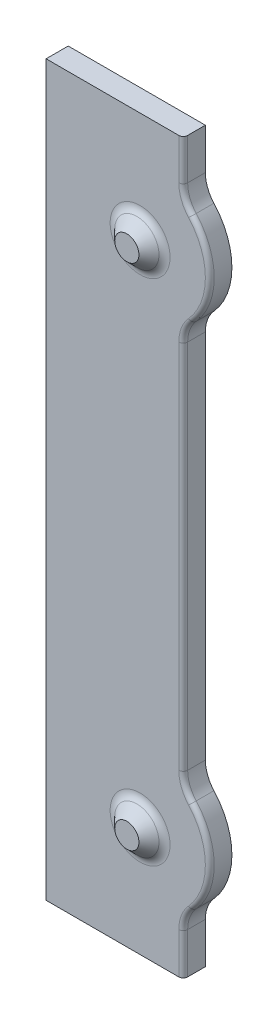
ISO-10303-21;
HEADER;
FILE_DESCRIPTION(('STEP AP214'),'2;1');
FILE_NAME('part.step','',(''),(''),'','','');
FILE_SCHEMA(('AUTOMOTIVE_DESIGN { 1 0 10303 214 1 1 1 1 }'));
ENDSEC;
DATA;
#1=APPLICATION_CONTEXT('core data for automotive mechanical design processes');
#2=APPLICATION_PROTOCOL_DEFINITION('international standard','automotive_design',2000,#1);
#3=PRODUCT_CONTEXT('',#1,'mechanical');
#4=PRODUCT('Part','Part','',(#3));
#5=PRODUCT_RELATED_PRODUCT_CATEGORY('part','',(#4));
#6=PRODUCT_DEFINITION_FORMATION('','',#4);
#7=PRODUCT_DEFINITION_CONTEXT('part definition',#1,'design');
#8=PRODUCT_DEFINITION('design','',#6,#7);
#9=PRODUCT_DEFINITION_SHAPE('','',#8);
#10=(LENGTH_UNIT() NAMED_UNIT(*) SI_UNIT(.MILLI.,.METRE.));
#11=(NAMED_UNIT(*) PLANE_ANGLE_UNIT() SI_UNIT($,.RADIAN.));
#12=(NAMED_UNIT(*) SI_UNIT($,.STERADIAN.) SOLID_ANGLE_UNIT());
#13=UNCERTAINTY_MEASURE_WITH_UNIT(LENGTH_MEASURE(1.E-05),#10,'distance_accuracy_value','');
#14=(GEOMETRIC_REPRESENTATION_CONTEXT(3) GLOBAL_UNCERTAINTY_ASSIGNED_CONTEXT((#13)) GLOBAL_UNIT_ASSIGNED_CONTEXT((#10,
#11,#12)) REPRESENTATION_CONTEXT('',''));
#15=CARTESIAN_POINT('',(0.,0.,0.));
#16=DIRECTION('',(0.,0.,1.));
#17=DIRECTION('',(1.,0.,0.));
#18=AXIS2_PLACEMENT_3D('',#15,#16,#17);
#19=CARTESIAN_POINT('',(0.,-29.21,2.54));
#20=DIRECTION('',(0.,0.,1.));
#21=DIRECTION('',(1.,0.,0.));
#22=AXIS2_PLACEMENT_3D('',#19,#20,#21);
#23=PLANE('',#22);
#24=CARTESIAN_POINT('',(0.,-29.21,2.54));
#25=DIRECTION('',(0.,0.,1.));
#26=DIRECTION('',(1.,0.,0.));
#27=AXIS2_PLACEMENT_3D('',#24,#25,#26);
#28=CIRCLE('',#27,3.43911372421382);
#29=CARTESIAN_POINT('',(3.43911372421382,-29.21,2.54));
#30=VERTEX_POINT('',#29);
#31=EDGE_CURVE('E12',#30,#30,#28,.F.);
#32=ORIENTED_EDGE('',*,*,#31,.T.);
#33=EDGE_LOOP('',(#32));
#34=FACE_BOUND('',#33,.T.);
#35=DIRECTION('',(1.,0.,0.));
#36=VECTOR('',#35,1.);
#37=CARTESIAN_POINT('',(-10.795,-41.8436129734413,2.54));
#38=LINE('',#37,#36);
#39=CARTESIAN_POINT('',(-10.795,-41.8436129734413,2.54));
#40=VERTEX_POINT('',#39);
#41=CARTESIAN_POINT('',(4.44500000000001,-41.8436129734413,2.54));
#42=VERTEX_POINT('',#41);
#43=EDGE_CURVE('E160',#40,#42,#38,.T.);
#44=ORIENTED_EDGE('',*,*,#43,.T.);
#45=DIRECTION('',(0.,1.,0.));
#46=VECTOR('',#45,1.);
#47=CARTESIAN_POINT('',(4.44500000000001,-37.1289362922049,2.54));
#48=LINE('',#47,#46);
#49=CARTESIAN_POINT('',(4.44500000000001,-37.1289362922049,2.54));
#50=VERTEX_POINT('',#49);
#51=EDGE_CURVE('E236',#42,#50,#48,.T.);
#52=ORIENTED_EDGE('',*,*,#51,.T.);
#53=CARTESIAN_POINT('',(8.76300000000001,-37.1289362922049,2.54));
#54=DIRECTION('',(0.,0.,1.));
#55=DIRECTION('',(1.,0.,0.));
#56=AXIS2_PLACEMENT_3D('',#53,#54,#55);
#57=CIRCLE('',#56,4.318);
#58=CARTESIAN_POINT('',(5.55932258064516,-34.2338413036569,2.54));
#59=VERTEX_POINT('',#58);
#60=EDGE_CURVE('E234',#50,#59,#57,.F.);
#61=ORIENTED_EDGE('',*,*,#60,.T.);
#62=CARTESIAN_POINT('',(0.,-29.21,2.54));
#63=DIRECTION('',(0.,0.,1.));
#64=DIRECTION('',(1.,0.,0.));
#65=AXIS2_PLACEMENT_3D('',#62,#63,#64);
#66=CIRCLE('',#65,7.493);
#67=CARTESIAN_POINT('',(5.55932258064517,-24.1861586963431,2.54));
#68=VERTEX_POINT('',#67);
#69=EDGE_CURVE('E232',#59,#68,#66,.T.);
#70=ORIENTED_EDGE('',*,*,#69,.T.);
#71=CARTESIAN_POINT('',(8.76300000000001,-21.2910637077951,2.54));
#72=DIRECTION('',(0.,0.,1.));
#73=DIRECTION('',(1.,0.,0.));
#74=AXIS2_PLACEMENT_3D('',#71,#72,#73);
#75=CIRCLE('',#74,4.318);
#76=CARTESIAN_POINT('',(4.44500000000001,-21.2910637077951,2.54));
#77=VERTEX_POINT('',#76);
#78=EDGE_CURVE('E230',#68,#77,#75,.F.);
#79=ORIENTED_EDGE('',*,*,#78,.T.);
#80=DIRECTION('',(0.,1.,0.));
#81=VECTOR('',#80,1.);
#82=CARTESIAN_POINT('',(4.44500000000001,21.2910637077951,2.54));
#83=LINE('',#82,#81);
#84=CARTESIAN_POINT('',(4.44500000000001,21.2910637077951,2.54));
#85=VERTEX_POINT('',#84);
#86=EDGE_CURVE('E228',#77,#85,#83,.T.);
#87=ORIENTED_EDGE('',*,*,#86,.T.);
#88=CARTESIAN_POINT('',(8.76300000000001,21.2910637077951,2.54));
#89=DIRECTION('',(0.,0.,1.));
#90=DIRECTION('',(1.,0.,0.));
#91=AXIS2_PLACEMENT_3D('',#88,#89,#90);
#92=CIRCLE('',#91,4.318);
#93=CARTESIAN_POINT('',(5.55932258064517,24.1861586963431,2.54));
#94=VERTEX_POINT('',#93);
#95=EDGE_CURVE('E226',#85,#94,#92,.F.);
#96=ORIENTED_EDGE('',*,*,#95,.T.);
#97=CARTESIAN_POINT('',(0.,29.21,2.54));
#98=DIRECTION('',(0.,0.,1.));
#99=DIRECTION('',(1.,0.,0.));
#100=AXIS2_PLACEMENT_3D('',#97,#98,#99);
#101=CIRCLE('',#100,7.493);
#102=CARTESIAN_POINT('',(5.55932258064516,34.2338413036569,2.54));
#103=VERTEX_POINT('',#102);
#104=EDGE_CURVE('E220',#94,#103,#101,.T.);
#105=ORIENTED_EDGE('',*,*,#104,.T.);
#106=CARTESIAN_POINT('',(8.76300000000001,37.1289362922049,2.54));
#107=DIRECTION('',(0.,0.,1.));
#108=DIRECTION('',(1.,0.,0.));
#109=AXIS2_PLACEMENT_3D('',#106,#107,#108);
#110=CIRCLE('',#109,4.318);
#111=CARTESIAN_POINT('',(4.44500000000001,37.1289362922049,2.54));
#112=VERTEX_POINT('',#111);
#113=EDGE_CURVE('E222',#103,#112,#110,.F.);
#114=ORIENTED_EDGE('',*,*,#113,.T.);
#115=DIRECTION('',(0.,1.,0.));
#116=VECTOR('',#115,1.);
#117=CARTESIAN_POINT('',(4.44500000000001,41.8436129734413,2.54));
#118=LINE('',#117,#116);
#119=CARTESIAN_POINT('',(4.44500000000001,41.8436129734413,2.54));
#120=VERTEX_POINT('',#119);
#121=EDGE_CURVE('E224',#112,#120,#118,.T.);
#122=ORIENTED_EDGE('',*,*,#121,.T.);
#123=DIRECTION('',(-1.,0.,0.));
#124=VECTOR('',#123,1.);
#125=CARTESIAN_POINT('',(-10.795,41.8436129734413,2.54));
#126=LINE('',#125,#124);
#127=CARTESIAN_POINT('',(-10.795,41.8436129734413,2.54));
#128=VERTEX_POINT('',#127);
#129=EDGE_CURVE('E173',#120,#128,#126,.T.);
#130=ORIENTED_EDGE('',*,*,#129,.T.);
#131=DIRECTION('',(0.,-1.,0.));
#132=VECTOR('',#131,1.);
#133=CARTESIAN_POINT('',(-10.795,41.8436129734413,2.54));
#134=LINE('',#133,#132);
#135=EDGE_CURVE('E174',#128,#40,#134,.T.);
#136=ORIENTED_EDGE('',*,*,#135,.T.);
#137=EDGE_LOOP('',(#44,#52,#61,#70,#79,#87,#96,#105,#114,#122,#130,#136));
#138=FACE_BOUND('',#137,.T.);
#139=CARTESIAN_POINT('',(0.,29.21,2.54));
#140=DIRECTION('',(0.,0.,1.));
#141=DIRECTION('',(1.,0.,0.));
#142=AXIS2_PLACEMENT_3D('',#139,#140,#141);
#143=CIRCLE('',#142,3.43911372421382);
#144=CARTESIAN_POINT('',(3.43911372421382,29.21,2.54));
#145=VERTEX_POINT('',#144);
#146=EDGE_CURVE('E257',#145,#145,#143,.F.);
#147=ORIENTED_EDGE('',*,*,#146,.T.);
#148=EDGE_LOOP('',(#147));
#149=FACE_BOUND('',#148,.T.);
#150=ADVANCED_FACE('F39',(#34,#138,#149),#23,.T.);
#151=CARTESIAN_POINT('',(-10.795,41.8436129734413,2.54));
#152=DIRECTION('',(1.,0.,0.));
#153=DIRECTION('',(0.,0.,-1.));
#154=AXIS2_PLACEMENT_3D('',#151,#152,#153);
#155=PLANE('',#154);
#156=DIRECTION('',(0.,-1.,0.));
#157=VECTOR('',#156,1.);
#158=CARTESIAN_POINT('',(-10.795,41.8436129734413,0.));
#159=LINE('',#158,#157);
#160=CARTESIAN_POINT('',(-10.795,41.8436129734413,0.));
#161=VERTEX_POINT('',#160);
#162=CARTESIAN_POINT('',(-10.795,-41.8436129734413,0.));
#163=VERTEX_POINT('',#162);
#164=EDGE_CURVE('E186',#161,#163,#159,.T.);
#165=ORIENTED_EDGE('',*,*,#164,.T.);
#166=DIRECTION('',(0.,0.,-1.));
#167=VECTOR('',#166,1.);
#168=CARTESIAN_POINT('',(-10.795,-41.8436129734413,2.54));
#169=LINE('',#168,#167);
#170=EDGE_CURVE('E166',#40,#163,#169,.T.);
#171=ORIENTED_EDGE('',*,*,#170,.F.);
#172=ORIENTED_EDGE('',*,*,#135,.F.);
#173=DIRECTION('',(0.,0.,-1.));
#174=VECTOR('',#173,1.);
#175=CARTESIAN_POINT('',(-10.795,41.8436129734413,2.54));
#176=LINE('',#175,#174);
#177=EDGE_CURVE('E414',#128,#161,#176,.T.);
#178=ORIENTED_EDGE('',*,*,#177,.T.);
#179=EDGE_LOOP('',(#165,#171,#172,#178));
#180=FACE_BOUND('',#179,.T.);
#181=ADVANCED_FACE('F184',(#180),#155,.F.);
#182=CARTESIAN_POINT('',(-10.795,-41.8436129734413,2.54));
#183=DIRECTION('',(0.,1.,0.));
#184=DIRECTION('',(0.,0.,1.));
#185=AXIS2_PLACEMENT_3D('',#182,#183,#184);
#186=PLANE('',#185);
#187=DIRECTION('',(0.,0.,-1.));
#188=VECTOR('',#187,1.);
#189=CARTESIAN_POINT('',(4.95300000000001,-41.8436129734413,2.54));
#190=LINE('',#189,#188);
#191=CARTESIAN_POINT('',(4.95300000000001,-41.8436129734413,2.032));
#192=VERTEX_POINT('',#191);
#193=CARTESIAN_POINT('',(4.95300000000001,-41.8436129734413,0.));
#194=VERTEX_POINT('',#193);
#195=EDGE_CURVE('E188',#192,#194,#190,.T.);
#196=ORIENTED_EDGE('',*,*,#195,.F.);
#197=CARTESIAN_POINT('',(4.44500000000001,-41.8436129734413,2.032));
#198=DIRECTION('',(0.,1.,0.));
#199=DIRECTION('',(0.,0.,1.));
#200=AXIS2_PLACEMENT_3D('',#197,#198,#199);
#201=CIRCLE('',#200,0.508);
#202=EDGE_CURVE('E169',#192,#42,#201,.F.);
#203=ORIENTED_EDGE('',*,*,#202,.T.);
#204=ORIENTED_EDGE('',*,*,#43,.F.);
#205=ORIENTED_EDGE('',*,*,#170,.T.);
#206=DIRECTION('',(1.,0.,0.));
#207=VECTOR('',#206,1.);
#208=CARTESIAN_POINT('',(-10.795,-41.8436129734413,0.));
#209=LINE('',#208,#207);
#210=EDGE_CURVE('E416',#163,#194,#209,.T.);
#211=ORIENTED_EDGE('',*,*,#210,.T.);
#212=EDGE_LOOP('',(#196,#203,#204,#205,#211));
#213=FACE_BOUND('',#212,.T.);
#214=ADVANCED_FACE('F163',(#213),#186,.F.);
#215=CARTESIAN_POINT('',(4.95300000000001,-35.4936129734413,2.54));
#216=DIRECTION('',(-1.,0.,0.));
#217=DIRECTION('',(0.,0.,1.));
#218=AXIS2_PLACEMENT_3D('',#215,#216,#217);
#219=PLANE('',#218);
#220=DIRECTION('',(0.,0.,1.));
#221=VECTOR('',#220,1.);
#222=CARTESIAN_POINT('',(4.95300000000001,-37.1289362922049,2.54));
#223=LINE('',#222,#221);
#224=CARTESIAN_POINT('',(4.95300000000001,-37.1289362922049,0.));
#225=VERTEX_POINT('',#224);
#226=CARTESIAN_POINT('',(4.95300000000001,-37.1289362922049,2.032));
#227=VERTEX_POINT('',#226);
#228=EDGE_CURVE('E209',#225,#227,#223,.T.);
#229=ORIENTED_EDGE('',*,*,#228,.T.);
#230=DIRECTION('',(0.,1.,0.));
#231=VECTOR('',#230,1.);
#232=CARTESIAN_POINT('',(4.95300000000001,-41.8436129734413,2.032));
#233=LINE('',#232,#231);
#234=EDGE_CURVE('E238',#227,#192,#233,.F.);
#235=ORIENTED_EDGE('',*,*,#234,.T.);
#236=ORIENTED_EDGE('',*,*,#195,.T.);
#237=DIRECTION('',(0.,1.,0.));
#238=VECTOR('',#237,1.);
#239=CARTESIAN_POINT('',(4.95300000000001,-35.4936129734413,0.));
#240=LINE('',#239,#238);
#241=EDGE_CURVE('E418',#194,#225,#240,.T.);
#242=ORIENTED_EDGE('',*,*,#241,.T.);
#243=EDGE_LOOP('',(#229,#235,#236,#242));
#244=FACE_BOUND('',#243,.T.);
#245=ADVANCED_FACE('F334',(#244),#219,.F.);
#246=CARTESIAN_POINT('',(0.,-29.21,2.54));
#247=DIRECTION('',(0.,0.,-1.));
#248=DIRECTION('',(-1.,0.,0.));
#249=AXIS2_PLACEMENT_3D('',#246,#247,#248);
#250=CYLINDRICAL_SURFACE('',#249,8.001);
#251=DIRECTION('',(0.,0.,-1.));
#252=VECTOR('',#251,1.);
#253=CARTESIAN_POINT('',(5.93622580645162,-23.8455592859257,2.54));
#254=LINE('',#253,#252);
#255=CARTESIAN_POINT('',(5.93622580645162,-23.8455592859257,0.));
#256=VERTEX_POINT('',#255);
#257=CARTESIAN_POINT('',(5.93622580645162,-23.8455592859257,2.032));
#258=VERTEX_POINT('',#257);
#259=EDGE_CURVE('E206',#256,#258,#254,.F.);
#260=ORIENTED_EDGE('',*,*,#259,.T.);
#261=CARTESIAN_POINT('',(0.,-29.21,2.032));
#262=DIRECTION('',(0.,0.,1.));
#263=DIRECTION('',(1.,0.,0.));
#264=AXIS2_PLACEMENT_3D('',#261,#262,#263);
#265=CIRCLE('',#264,8.001);
#266=CARTESIAN_POINT('',(5.93622580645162,-34.5744407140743,2.032));
#267=VERTEX_POINT('',#266);
#268=EDGE_CURVE('E243',#258,#267,#265,.F.);
#269=ORIENTED_EDGE('',*,*,#268,.T.);
#270=DIRECTION('',(0.,0.,-1.));
#271=VECTOR('',#270,1.);
#272=CARTESIAN_POINT('',(5.93622580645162,-34.5744407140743,2.54));
#273=LINE('',#272,#271);
#274=CARTESIAN_POINT('',(5.93622580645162,-34.5744407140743,0.));
#275=VERTEX_POINT('',#274);
#276=EDGE_CURVE('E204',#267,#275,#273,.T.);
#277=ORIENTED_EDGE('',*,*,#276,.T.);
#278=CARTESIAN_POINT('',(0.,-29.21,0.));
#279=DIRECTION('',(0.,0.,1.));
#280=DIRECTION('',(1.,0.,0.));
#281=AXIS2_PLACEMENT_3D('',#278,#279,#280);
#282=CIRCLE('',#281,8.001);
#283=EDGE_CURVE('E421',#275,#256,#282,.T.);
#284=ORIENTED_EDGE('',*,*,#283,.T.);
#285=EDGE_LOOP('',(#260,#269,#277,#284));
#286=FACE_BOUND('',#285,.T.);
#287=ADVANCED_FACE('F330',(#286),#250,.T.);
#288=CARTESIAN_POINT('',(4.95300000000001,22.9263870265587,2.54));
#289=DIRECTION('',(-1.,0.,0.));
#290=DIRECTION('',(0.,0.,1.));
#291=AXIS2_PLACEMENT_3D('',#288,#289,#290);
#292=PLANE('',#291);
#293=DIRECTION('',(0.,0.,1.));
#294=VECTOR('',#293,1.);
#295=CARTESIAN_POINT('',(4.95300000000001,21.2910637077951,2.54));
#296=LINE('',#295,#294);
#297=CARTESIAN_POINT('',(4.95300000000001,21.2910637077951,0.));
#298=VERTEX_POINT('',#297);
#299=CARTESIAN_POINT('',(4.95300000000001,21.2910637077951,2.032));
#300=VERTEX_POINT('',#299);
#301=EDGE_CURVE('E201',#298,#300,#296,.T.);
#302=ORIENTED_EDGE('',*,*,#301,.T.);
#303=DIRECTION('',(0.,1.,0.));
#304=VECTOR('',#303,1.);
#305=CARTESIAN_POINT('',(4.95300000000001,-21.2910637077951,2.032));
#306=LINE('',#305,#304);
#307=CARTESIAN_POINT('',(4.95300000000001,-21.2910637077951,2.032));
#308=VERTEX_POINT('',#307);
#309=EDGE_CURVE('E247',#300,#308,#306,.F.);
#310=ORIENTED_EDGE('',*,*,#309,.T.);
#311=DIRECTION('',(0.,0.,1.));
#312=VECTOR('',#311,1.);
#313=CARTESIAN_POINT('',(4.95300000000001,-21.2910637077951,0.));
#314=LINE('',#313,#312);
#315=CARTESIAN_POINT('',(4.95300000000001,-21.2910637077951,0.));
#316=VERTEX_POINT('',#315);
#317=EDGE_CURVE('E199',#308,#316,#314,.F.);
#318=ORIENTED_EDGE('',*,*,#317,.T.);
#319=DIRECTION('',(0.,1.,0.));
#320=VECTOR('',#319,1.);
#321=CARTESIAN_POINT('',(4.95300000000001,22.9263870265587,0.));
#322=LINE('',#321,#320);
#323=EDGE_CURVE('E424',#316,#298,#322,.T.);
#324=ORIENTED_EDGE('',*,*,#323,.T.);
#325=EDGE_LOOP('',(#302,#310,#318,#324));
#326=FACE_BOUND('',#325,.T.);
#327=ADVANCED_FACE('F326',(#326),#292,.F.);
#328=CARTESIAN_POINT('',(0.,29.21,2.54));
#329=DIRECTION('',(0.,0.,-1.));
#330=DIRECTION('',(-1.,0.,0.));
#331=AXIS2_PLACEMENT_3D('',#328,#329,#330);
#332=CYLINDRICAL_SURFACE('',#331,8.001);
#333=DIRECTION('',(0.,0.,-1.));
#334=VECTOR('',#333,1.);
#335=CARTESIAN_POINT('',(5.93622580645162,34.5744407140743,2.54));
#336=LINE('',#335,#334);
#337=CARTESIAN_POINT('',(5.93622580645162,34.5744407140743,0.));
#338=VERTEX_POINT('',#337);
#339=CARTESIAN_POINT('',(5.93622580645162,34.5744407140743,2.032));
#340=VERTEX_POINT('',#339);
#341=EDGE_CURVE('E197',#338,#340,#336,.F.);
#342=ORIENTED_EDGE('',*,*,#341,.T.);
#343=CARTESIAN_POINT('',(0.,29.21,2.032));
#344=DIRECTION('',(0.,0.,1.));
#345=DIRECTION('',(1.,0.,0.));
#346=AXIS2_PLACEMENT_3D('',#343,#344,#345);
#347=CIRCLE('',#346,8.001);
#348=CARTESIAN_POINT('',(5.93622580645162,23.8455592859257,2.032));
#349=VERTEX_POINT('',#348);
#350=EDGE_CURVE('E255',#340,#349,#347,.F.);
#351=ORIENTED_EDGE('',*,*,#350,.T.);
#352=DIRECTION('',(0.,0.,-1.));
#353=VECTOR('',#352,1.);
#354=CARTESIAN_POINT('',(5.93622580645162,23.8455592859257,2.54));
#355=LINE('',#354,#353);
#356=CARTESIAN_POINT('',(5.93622580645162,23.8455592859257,0.));
#357=VERTEX_POINT('',#356);
#358=EDGE_CURVE('E190',#349,#357,#355,.T.);
#359=ORIENTED_EDGE('',*,*,#358,.T.);
#360=CARTESIAN_POINT('',(0.,29.21,0.));
#361=DIRECTION('',(0.,0.,1.));
#362=DIRECTION('',(-1.,0.,0.));
#363=AXIS2_PLACEMENT_3D('',#360,#361,#362);
#364=CIRCLE('',#363,8.001);
#365=EDGE_CURVE('E427',#357,#338,#364,.T.);
#366=ORIENTED_EDGE('',*,*,#365,.T.);
#367=EDGE_LOOP('',(#342,#351,#359,#366));
#368=FACE_BOUND('',#367,.T.);
#369=ADVANCED_FACE('F323',(#368),#332,.T.);
#370=CARTESIAN_POINT('',(4.95300000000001,41.8436129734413,2.54));
#371=DIRECTION('',(-1.,0.,0.));
#372=DIRECTION('',(0.,0.,1.));
#373=AXIS2_PLACEMENT_3D('',#370,#371,#372);
#374=PLANE('',#373);
#375=DIRECTION('',(0.,0.,-1.));
#376=VECTOR('',#375,1.);
#377=CARTESIAN_POINT('',(4.95300000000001,41.8436129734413,2.54));
#378=LINE('',#377,#376);
#379=CARTESIAN_POINT('',(4.95300000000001,41.8436129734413,2.032));
#380=VERTEX_POINT('',#379);
#381=CARTESIAN_POINT('',(4.95300000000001,41.8436129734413,0.));
#382=VERTEX_POINT('',#381);
#383=EDGE_CURVE('E192',#380,#382,#378,.T.);
#384=ORIENTED_EDGE('',*,*,#383,.F.);
#385=DIRECTION('',(0.,1.,0.));
#386=VECTOR('',#385,1.);
#387=CARTESIAN_POINT('',(4.95300000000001,37.1289362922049,2.032));
#388=LINE('',#387,#386);
#389=CARTESIAN_POINT('',(4.95300000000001,37.1289362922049,2.032));
#390=VERTEX_POINT('',#389);
#391=EDGE_CURVE('E62',#380,#390,#388,.F.);
#392=ORIENTED_EDGE('',*,*,#391,.T.);
#393=DIRECTION('',(0.,0.,1.));
#394=VECTOR('',#393,1.);
#395=CARTESIAN_POINT('',(4.95300000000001,37.1289362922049,0.));
#396=LINE('',#395,#394);
#397=CARTESIAN_POINT('',(4.95300000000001,37.1289362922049,0.));
#398=VERTEX_POINT('',#397);
#399=EDGE_CURVE('E187',#390,#398,#396,.F.);
#400=ORIENTED_EDGE('',*,*,#399,.T.);
#401=DIRECTION('',(0.,1.,0.));
#402=VECTOR('',#401,1.);
#403=CARTESIAN_POINT('',(4.95300000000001,41.8436129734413,0.));
#404=LINE('',#403,#402);
#405=EDGE_CURVE('E430',#398,#382,#404,.T.);
#406=ORIENTED_EDGE('',*,*,#405,.T.);
#407=EDGE_LOOP('',(#384,#392,#400,#406));
#408=FACE_BOUND('',#407,.T.);
#409=ADVANCED_FACE('F319',(#408),#374,.F.);
#410=CARTESIAN_POINT('',(-10.795,41.8436129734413,2.54));
#411=DIRECTION('',(0.,-1.,0.));
#412=DIRECTION('',(0.,0.,-1.));
#413=AXIS2_PLACEMENT_3D('',#410,#411,#412);
#414=PLANE('',#413);
#415=ORIENTED_EDGE('',*,*,#129,.F.);
#416=CARTESIAN_POINT('',(4.44500000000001,41.8436129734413,2.032));
#417=DIRECTION('',(0.,-1.,0.));
#418=DIRECTION('',(0.,0.,-1.));
#419=AXIS2_PLACEMENT_3D('',#416,#417,#418);
#420=CIRCLE('',#419,0.508);
#421=EDGE_CURVE('E251',#120,#380,#420,.F.);
#422=ORIENTED_EDGE('',*,*,#421,.T.);
#423=ORIENTED_EDGE('',*,*,#383,.T.);
#424=DIRECTION('',(-1.,0.,0.));
#425=VECTOR('',#424,1.);
#426=CARTESIAN_POINT('',(-10.795,41.8436129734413,0.));
#427=LINE('',#426,#425);
#428=EDGE_CURVE('E182',#382,#161,#427,.T.);
#429=ORIENTED_EDGE('',*,*,#428,.T.);
#430=ORIENTED_EDGE('',*,*,#177,.F.);
#431=EDGE_LOOP('',(#415,#422,#423,#429,#430));
#432=FACE_BOUND('',#431,.T.);
#433=ADVANCED_FACE('F315',(#432),#414,.F.);
#434=CARTESIAN_POINT('',(0.,-29.21,0.));
#435=DIRECTION('',(0.,0.,1.));
#436=DIRECTION('',(1.,0.,0.));
#437=AXIS2_PLACEMENT_3D('',#434,#435,#436);
#438=PLANE('',#437);
#439=ORIENTED_EDGE('',*,*,#164,.F.);
#440=ORIENTED_EDGE('',*,*,#428,.F.);
#441=ORIENTED_EDGE('',*,*,#405,.F.);
#442=CARTESIAN_POINT('',(8.76300000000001,37.1289362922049,0.));
#443=DIRECTION('',(0.,0.,1.));
#444=DIRECTION('',(1.,0.,0.));
#445=AXIS2_PLACEMENT_3D('',#442,#443,#444);
#446=CIRCLE('',#445,3.81);
#447=EDGE_CURVE('E212',#398,#338,#446,.T.);
#448=ORIENTED_EDGE('',*,*,#447,.T.);
#449=ORIENTED_EDGE('',*,*,#365,.F.);
#450=CARTESIAN_POINT('',(8.76300000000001,21.2910637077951,0.));
#451=DIRECTION('',(0.,0.,1.));
#452=DIRECTION('',(1.,0.,0.));
#453=AXIS2_PLACEMENT_3D('',#450,#451,#452);
#454=CIRCLE('',#453,3.81);
#455=EDGE_CURVE('E214',#357,#298,#454,.T.);
#456=ORIENTED_EDGE('',*,*,#455,.T.);
#457=ORIENTED_EDGE('',*,*,#323,.F.);
#458=CARTESIAN_POINT('',(8.76300000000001,-21.2910637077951,0.));
#459=DIRECTION('',(0.,0.,1.));
#460=DIRECTION('',(1.,0.,0.));
#461=AXIS2_PLACEMENT_3D('',#458,#459,#460);
#462=CIRCLE('',#461,3.81);
#463=EDGE_CURVE('E216',#316,#256,#462,.T.);
#464=ORIENTED_EDGE('',*,*,#463,.T.);
#465=ORIENTED_EDGE('',*,*,#283,.F.);
#466=CARTESIAN_POINT('',(8.76300000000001,-37.1289362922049,0.));
#467=DIRECTION('',(0.,0.,1.));
#468=DIRECTION('',(1.,0.,0.));
#469=AXIS2_PLACEMENT_3D('',#466,#467,#468);
#470=CIRCLE('',#469,3.81);
#471=EDGE_CURVE('E218',#275,#225,#470,.T.);
#472=ORIENTED_EDGE('',*,*,#471,.T.);
#473=ORIENTED_EDGE('',*,*,#241,.F.);
#474=ORIENTED_EDGE('',*,*,#210,.F.);
#475=EDGE_LOOP('',(#439,#440,#441,#448,#449,#456,#457,#464,#465,#472,#473,#474));
#476=FACE_BOUND('',#475,.T.);
#477=ADVANCED_FACE('F311',(#476),#438,.F.);
#478=CARTESIAN_POINT('',(8.76300000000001,37.1289362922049,2.54));
#479=DIRECTION('',(0.,0.,-1.));
#480=DIRECTION('',(-1.,0.,0.));
#481=AXIS2_PLACEMENT_3D('',#478,#479,#480);
#482=CYLINDRICAL_SURFACE('',#481,3.81);
#483=ORIENTED_EDGE('',*,*,#399,.F.);
#484=CARTESIAN_POINT('',(8.76300000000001,37.1289362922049,2.032));
#485=DIRECTION('',(0.,0.,1.));
#486=DIRECTION('',(1.,0.,0.));
#487=AXIS2_PLACEMENT_3D('',#484,#485,#486);
#488=CIRCLE('',#487,3.81);
#489=EDGE_CURVE('E54',#390,#340,#488,.T.);
#490=ORIENTED_EDGE('',*,*,#489,.T.);
#491=ORIENTED_EDGE('',*,*,#341,.F.);
#492=ORIENTED_EDGE('',*,*,#447,.F.);
#493=EDGE_LOOP('',(#483,#490,#491,#492));
#494=FACE_BOUND('',#493,.T.);
#495=ADVANCED_FACE('F314',(#494),#482,.F.);
#496=CARTESIAN_POINT('',(8.76300000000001,21.2910637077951,2.54));
#497=DIRECTION('',(0.,0.,-1.));
#498=DIRECTION('',(-1.,0.,0.));
#499=AXIS2_PLACEMENT_3D('',#496,#497,#498);
#500=CYLINDRICAL_SURFACE('',#499,3.81);
#501=ORIENTED_EDGE('',*,*,#358,.F.);
#502=CARTESIAN_POINT('',(8.76300000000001,21.2910637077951,2.032));
#503=DIRECTION('',(0.,0.,1.));
#504=DIRECTION('',(1.,0.,0.));
#505=AXIS2_PLACEMENT_3D('',#502,#503,#504);
#506=CIRCLE('',#505,3.81);
#507=EDGE_CURVE('E249',#349,#300,#506,.T.);
#508=ORIENTED_EDGE('',*,*,#507,.T.);
#509=ORIENTED_EDGE('',*,*,#301,.F.);
#510=ORIENTED_EDGE('',*,*,#455,.F.);
#511=EDGE_LOOP('',(#501,#508,#509,#510));
#512=FACE_BOUND('',#511,.T.);
#513=ADVANCED_FACE('F343',(#512),#500,.F.);
#514=CARTESIAN_POINT('',(8.76300000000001,-21.2910637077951,2.54));
#515=DIRECTION('',(0.,0.,-1.));
#516=DIRECTION('',(-1.,0.,0.));
#517=AXIS2_PLACEMENT_3D('',#514,#515,#516);
#518=CYLINDRICAL_SURFACE('',#517,3.81);
#519=ORIENTED_EDGE('',*,*,#317,.F.);
#520=CARTESIAN_POINT('',(8.76300000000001,-21.2910637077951,2.032));
#521=DIRECTION('',(0.,0.,1.));
#522=DIRECTION('',(1.,0.,0.));
#523=AXIS2_PLACEMENT_3D('',#520,#521,#522);
#524=CIRCLE('',#523,3.81);
#525=EDGE_CURVE('E245',#308,#258,#524,.T.);
#526=ORIENTED_EDGE('',*,*,#525,.T.);
#527=ORIENTED_EDGE('',*,*,#259,.F.);
#528=ORIENTED_EDGE('',*,*,#463,.F.);
#529=EDGE_LOOP('',(#519,#526,#527,#528));
#530=FACE_BOUND('',#529,.T.);
#531=ADVANCED_FACE('F346',(#530),#518,.F.);
#532=CARTESIAN_POINT('',(8.76300000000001,-37.1289362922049,2.54));
#533=DIRECTION('',(0.,0.,-1.));
#534=DIRECTION('',(-1.,0.,0.));
#535=AXIS2_PLACEMENT_3D('',#532,#533,#534);
#536=CYLINDRICAL_SURFACE('',#535,3.81);
#537=ORIENTED_EDGE('',*,*,#276,.F.);
#538=CARTESIAN_POINT('',(8.76300000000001,-37.1289362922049,2.032));
#539=DIRECTION('',(0.,0.,1.));
#540=DIRECTION('',(1.,0.,0.));
#541=AXIS2_PLACEMENT_3D('',#538,#539,#540);
#542=CIRCLE('',#541,3.81);
#543=EDGE_CURVE('E241',#267,#227,#542,.T.);
#544=ORIENTED_EDGE('',*,*,#543,.T.);
#545=ORIENTED_EDGE('',*,*,#228,.F.);
#546=ORIENTED_EDGE('',*,*,#471,.F.);
#547=EDGE_LOOP('',(#537,#544,#545,#546));
#548=FACE_BOUND('',#547,.T.);
#549=ADVANCED_FACE('F350',(#548),#536,.F.);
#550=CARTESIAN_POINT('',(4.44500000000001,-29.21,2.032));
#551=DIRECTION('',(0.,-1.,0.));
#552=DIRECTION('',(0.,0.,-1.));
#553=AXIS2_PLACEMENT_3D('',#550,#551,#552);
#554=CYLINDRICAL_SURFACE('',#553,0.508);
#555=ORIENTED_EDGE('',*,*,#421,.F.);
#556=ORIENTED_EDGE('',*,*,#121,.F.);
#557=CARTESIAN_POINT('',(4.44500000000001,37.1289362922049,2.032));
#558=DIRECTION('',(0.,-1.,0.));
#559=DIRECTION('',(0.,0.,-1.));
#560=AXIS2_PLACEMENT_3D('',#557,#558,#559);
#561=CIRCLE('',#560,0.508);
#562=EDGE_CURVE('E279',#390,#112,#561,.T.);
#563=ORIENTED_EDGE('',*,*,#562,.F.);
#564=ORIENTED_EDGE('',*,*,#391,.F.);
#565=EDGE_LOOP('',(#555,#556,#563,#564));
#566=FACE_BOUND('',#565,.T.);
#567=ADVANCED_FACE('F354',(#566),#554,.T.);
#568=CARTESIAN_POINT('',(8.76300000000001,37.1289362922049,2.032));
#569=DIRECTION('',(0.,0.,1.));
#570=DIRECTION('',(1.,0.,0.));
#571=AXIS2_PLACEMENT_3D('',#568,#569,#570);
#572=TOROIDAL_SURFACE('',#571,4.318,0.508);
#573=ORIENTED_EDGE('',*,*,#562,.T.);
#574=ORIENTED_EDGE('',*,*,#113,.F.);
#575=CARTESIAN_POINT('',(5.55932258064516,34.2338413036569,2.032));
#576=DIRECTION('',(0.670471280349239,-0.741935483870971,0.));
#577=DIRECTION('',(0.741935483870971,0.670471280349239,0.));
#578=AXIS2_PLACEMENT_3D('',#575,#576,#577);
#579=CIRCLE('',#578,0.508);
#580=EDGE_CURVE('E276',#340,#103,#579,.T.);
#581=ORIENTED_EDGE('',*,*,#580,.F.);
#582=ORIENTED_EDGE('',*,*,#489,.F.);
#583=EDGE_LOOP('',(#573,#574,#581,#582));
#584=FACE_BOUND('',#583,.T.);
#585=ADVANCED_FACE('F383',(#584),#572,.T.);
#586=CARTESIAN_POINT('',(0.,29.21,2.032));
#587=DIRECTION('',(0.,0.,1.));
#588=DIRECTION('',(1.,0.,0.));
#589=AXIS2_PLACEMENT_3D('',#586,#587,#588);
#590=TOROIDAL_SURFACE('',#589,7.493,0.508);
#591=ORIENTED_EDGE('',*,*,#580,.T.);
#592=ORIENTED_EDGE('',*,*,#104,.F.);
#593=CARTESIAN_POINT('',(5.55932258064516,24.1861586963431,2.032));
#594=DIRECTION('',(-0.670471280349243,-0.741935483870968,0.));
#595=DIRECTION('',(0.741935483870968,-0.670471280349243,0.));
#596=AXIS2_PLACEMENT_3D('',#593,#594,#595);
#597=CIRCLE('',#596,0.508);
#598=EDGE_CURVE('E273',#349,#94,#597,.T.);
#599=ORIENTED_EDGE('',*,*,#598,.F.);
#600=ORIENTED_EDGE('',*,*,#350,.F.);
#601=EDGE_LOOP('',(#591,#592,#599,#600));
#602=FACE_BOUND('',#601,.T.);
#603=ADVANCED_FACE('F379',(#602),#590,.T.);
#604=CARTESIAN_POINT('',(8.76300000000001,21.2910637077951,2.032));
#605=DIRECTION('',(0.,0.,1.));
#606=DIRECTION('',(1.,0.,0.));
#607=AXIS2_PLACEMENT_3D('',#604,#605,#606);
#608=TOROIDAL_SURFACE('',#607,4.318,0.508);
#609=ORIENTED_EDGE('',*,*,#598,.T.);
#610=ORIENTED_EDGE('',*,*,#95,.F.);
#611=CARTESIAN_POINT('',(4.44500000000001,21.2910637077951,2.032));
#612=DIRECTION('',(0.,-1.,0.));
#613=DIRECTION('',(0.,0.,-1.));
#614=AXIS2_PLACEMENT_3D('',#611,#612,#613);
#615=CIRCLE('',#614,0.508);
#616=EDGE_CURVE('E270',#300,#85,#615,.T.);
#617=ORIENTED_EDGE('',*,*,#616,.F.);
#618=ORIENTED_EDGE('',*,*,#507,.F.);
#619=EDGE_LOOP('',(#609,#610,#617,#618));
#620=FACE_BOUND('',#619,.T.);
#621=ADVANCED_FACE('F375',(#620),#608,.T.);
#622=CARTESIAN_POINT('',(4.44500000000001,-29.21,2.032));
#623=DIRECTION('',(0.,-1.,0.));
#624=DIRECTION('',(0.,0.,-1.));
#625=AXIS2_PLACEMENT_3D('',#622,#623,#624);
#626=CYLINDRICAL_SURFACE('',#625,0.508);
#627=ORIENTED_EDGE('',*,*,#616,.T.);
#628=ORIENTED_EDGE('',*,*,#86,.F.);
#629=CARTESIAN_POINT('',(4.44500000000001,-21.2910637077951,2.032));
#630=DIRECTION('',(0.,-1.,0.));
#631=DIRECTION('',(0.,0.,-1.));
#632=AXIS2_PLACEMENT_3D('',#629,#630,#631);
#633=CIRCLE('',#632,0.508);
#634=EDGE_CURVE('E267',#308,#77,#633,.T.);
#635=ORIENTED_EDGE('',*,*,#634,.F.);
#636=ORIENTED_EDGE('',*,*,#309,.F.);
#637=EDGE_LOOP('',(#627,#628,#635,#636));
#638=FACE_BOUND('',#637,.T.);
#639=ADVANCED_FACE('F371',(#638),#626,.T.);
#640=CARTESIAN_POINT('',(8.76300000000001,-21.2910637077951,2.032));
#641=DIRECTION('',(0.,0.,1.));
#642=DIRECTION('',(1.,0.,0.));
#643=AXIS2_PLACEMENT_3D('',#640,#641,#642);
#644=TOROIDAL_SURFACE('',#643,4.318,0.508);
#645=ORIENTED_EDGE('',*,*,#634,.T.);
#646=ORIENTED_EDGE('',*,*,#78,.F.);
#647=CARTESIAN_POINT('',(5.55932258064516,-24.1861586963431,2.032));
#648=DIRECTION('',(0.670471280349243,-0.741935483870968,0.));
#649=DIRECTION('',(0.741935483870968,0.670471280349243,0.));
#650=AXIS2_PLACEMENT_3D('',#647,#648,#649);
#651=CIRCLE('',#650,0.508);
#652=EDGE_CURVE('E264',#258,#68,#651,.T.);
#653=ORIENTED_EDGE('',*,*,#652,.F.);
#654=ORIENTED_EDGE('',*,*,#525,.F.);
#655=EDGE_LOOP('',(#645,#646,#653,#654));
#656=FACE_BOUND('',#655,.T.);
#657=ADVANCED_FACE('F367',(#656),#644,.T.);
#658=CARTESIAN_POINT('',(0.,-29.21,2.032));
#659=DIRECTION('',(0.,0.,1.));
#660=DIRECTION('',(1.,0.,0.));
#661=AXIS2_PLACEMENT_3D('',#658,#659,#660);
#662=TOROIDAL_SURFACE('',#661,7.493,0.508);
#663=ORIENTED_EDGE('',*,*,#652,.T.);
#664=ORIENTED_EDGE('',*,*,#69,.F.);
#665=CARTESIAN_POINT('',(5.55932258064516,-34.2338413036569,2.032));
#666=DIRECTION('',(-0.670471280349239,-0.741935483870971,0.));
#667=DIRECTION('',(0.741935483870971,-0.670471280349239,0.));
#668=AXIS2_PLACEMENT_3D('',#665,#666,#667);
#669=CIRCLE('',#668,0.508);
#670=EDGE_CURVE('E260',#267,#59,#669,.T.);
#671=ORIENTED_EDGE('',*,*,#670,.F.);
#672=ORIENTED_EDGE('',*,*,#268,.F.);
#673=EDGE_LOOP('',(#663,#664,#671,#672));
#674=FACE_BOUND('',#673,.T.);
#675=ADVANCED_FACE('F363',(#674),#662,.T.);
#676=CARTESIAN_POINT('',(8.76300000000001,-37.1289362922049,2.032));
#677=DIRECTION('',(0.,0.,1.));
#678=DIRECTION('',(1.,0.,0.));
#679=AXIS2_PLACEMENT_3D('',#676,#677,#678);
#680=TOROIDAL_SURFACE('',#679,4.318,0.508);
#681=ORIENTED_EDGE('',*,*,#670,.T.);
#682=ORIENTED_EDGE('',*,*,#60,.F.);
#683=CARTESIAN_POINT('',(4.44500000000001,-37.1289362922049,2.032));
#684=DIRECTION('',(0.,-1.,0.));
#685=DIRECTION('',(0.,0.,-1.));
#686=AXIS2_PLACEMENT_3D('',#683,#684,#685);
#687=CIRCLE('',#686,0.508);
#688=EDGE_CURVE('E258',#227,#50,#687,.T.);
#689=ORIENTED_EDGE('',*,*,#688,.F.);
#690=ORIENTED_EDGE('',*,*,#543,.F.);
#691=EDGE_LOOP('',(#681,#682,#689,#690));
#692=FACE_BOUND('',#691,.T.);
#693=ADVANCED_FACE('F359',(#692),#680,.T.);
#694=CARTESIAN_POINT('',(4.44500000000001,-29.21,2.032));
#695=DIRECTION('',(0.,-1.,0.));
#696=DIRECTION('',(0.,0.,-1.));
#697=AXIS2_PLACEMENT_3D('',#694,#695,#696);
#698=CYLINDRICAL_SURFACE('',#697,0.508);
#699=ORIENTED_EDGE('',*,*,#202,.F.);
#700=ORIENTED_EDGE('',*,*,#234,.F.);
#701=ORIENTED_EDGE('',*,*,#688,.T.);
#702=ORIENTED_EDGE('',*,*,#51,.F.);
#703=EDGE_LOOP('',(#699,#700,#701,#702));
#704=FACE_BOUND('',#703,.T.);
#705=ADVANCED_FACE('F356',(#704),#698,.T.);
#706=CARTESIAN_POINT('',(0.,29.21,4.064));
#707=DIRECTION('',(0.,0.,-1.));
#708=DIRECTION('',(-1.,0.,0.));
#709=AXIS2_PLACEMENT_3D('',#706,#707,#708);
#710=PLANE('',#709);
#711=CARTESIAN_POINT('',(0.,29.21,4.064));
#712=DIRECTION('',(0.,0.,-1.));
#713=DIRECTION('',(-1.,0.,0.));
#714=AXIS2_PLACEMENT_3D('',#711,#712,#713);
#715=CIRCLE('',#714,1.3890625);
#716=CARTESIAN_POINT('',(-1.3890625,29.21,4.064));
#717=VERTEX_POINT('',#716);
#718=EDGE_CURVE('E261',#717,#717,#715,.T.);
#719=ORIENTED_EDGE('',*,*,#718,.F.);
#720=EDGE_LOOP('',(#719));
#721=FACE_BOUND('',#720,.T.);
#722=ADVANCED_FACE('F309',(#721),#710,.F.);
#723=CARTESIAN_POINT('',(0.,29.21,4.064));
#724=DIRECTION('',(0.,0.,-1.));
#725=DIRECTION('',(-1.,0.,0.));
#726=AXIS2_PLACEMENT_3D('',#723,#724,#725);
#727=CONICAL_SURFACE('',#726,1.3890625,0.785398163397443);
#728=CARTESIAN_POINT('',(0.,29.21,2.91197438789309));
#729=DIRECTION('',(0.,0.,1.));
#730=DIRECTION('',(1.,0.,0.));
#731=AXIS2_PLACEMENT_3D('',#728,#729,#730);
#732=CIRCLE('',#731,2.5410881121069);
#733=CARTESIAN_POINT('',(2.5410881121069,29.21,2.91197438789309));
#734=VERTEX_POINT('',#733);
#735=EDGE_CURVE('E284',#734,#734,#732,.T.);
#736=ORIENTED_EDGE('',*,*,#735,.T.);
#737=EDGE_LOOP('',(#736));
#738=FACE_BOUND('',#737,.T.);
#739=ORIENTED_EDGE('',*,*,#718,.T.);
#740=EDGE_LOOP('',(#739));
#741=FACE_BOUND('',#740,.T.);
#742=ADVANCED_FACE('F392',(#738,#741),#727,.T.);
#743=CARTESIAN_POINT('',(0.,29.21,3.81));
#744=DIRECTION('',(0.,0.,1.));
#745=DIRECTION('',(1.,0.,0.));
#746=AXIS2_PLACEMENT_3D('',#743,#744,#745);
#747=TOROIDAL_SURFACE('',#746,3.43911372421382,1.27);
#748=ORIENTED_EDGE('',*,*,#735,.F.);
#749=EDGE_LOOP('',(#748));
#750=FACE_BOUND('',#749,.T.);
#751=ORIENTED_EDGE('',*,*,#146,.F.);
#752=EDGE_LOOP('',(#751));
#753=FACE_BOUND('',#752,.T.);
#754=ADVANCED_FACE('F390',(#750,#753),#747,.F.);
#755=CARTESIAN_POINT('',(0.,-29.21,4.064));
#756=DIRECTION('',(0.,0.,-1.));
#757=DIRECTION('',(-1.,0.,0.));
#758=AXIS2_PLACEMENT_3D('',#755,#756,#757);
#759=PLANE('',#758);
#760=CARTESIAN_POINT('',(0.,-29.21,4.064));
#761=DIRECTION('',(0.,0.,1.));
#762=DIRECTION('',(-1.,0.,0.));
#763=AXIS2_PLACEMENT_3D('',#760,#761,#762);
#764=CIRCLE('',#763,1.3890625);
#765=CARTESIAN_POINT('',(-1.3890625,-29.21,4.064));
#766=VERTEX_POINT('',#765);
#767=EDGE_CURVE('E408',#766,#766,#764,.T.);
#768=ORIENTED_EDGE('',*,*,#767,.T.);
#769=EDGE_LOOP('',(#768));
#770=FACE_BOUND('',#769,.T.);
#771=ADVANCED_FACE('F297',(#770),#759,.F.);
#772=CARTESIAN_POINT('',(0.,-29.21,4.064));
#773=DIRECTION('',(0.,0.,-1.));
#774=DIRECTION('',(-1.,0.,0.));
#775=AXIS2_PLACEMENT_3D('',#772,#773,#774);
#776=CONICAL_SURFACE('',#775,1.3890625,0.785398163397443);
#777=CARTESIAN_POINT('',(0.,-29.21,2.91197438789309));
#778=DIRECTION('',(0.,0.,1.));
#779=DIRECTION('',(1.,0.,0.));
#780=AXIS2_PLACEMENT_3D('',#777,#778,#779);
#781=CIRCLE('',#780,2.5410881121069);
#782=CARTESIAN_POINT('',(2.5410881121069,-29.21,2.91197438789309));
#783=VERTEX_POINT('',#782);
#784=EDGE_CURVE('E47',#783,#783,#781,.T.);
#785=ORIENTED_EDGE('',*,*,#784,.T.);
#786=EDGE_LOOP('',(#785));
#787=FACE_BOUND('',#786,.T.);
#788=ORIENTED_EDGE('',*,*,#767,.F.);
#789=EDGE_LOOP('',(#788));
#790=FACE_BOUND('',#789,.T.);
#791=ADVANCED_FACE('F289',(#787,#790),#776,.T.);
#792=CARTESIAN_POINT('',(0.,-29.21,3.81));
#793=DIRECTION('',(0.,0.,1.));
#794=DIRECTION('',(1.,0.,0.));
#795=AXIS2_PLACEMENT_3D('',#792,#793,#794);
#796=TOROIDAL_SURFACE('',#795,3.43911372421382,1.27);
#797=ORIENTED_EDGE('',*,*,#31,.F.);
#798=EDGE_LOOP('',(#797));
#799=FACE_BOUND('',#798,.T.);
#800=ORIENTED_EDGE('',*,*,#784,.F.);
#801=EDGE_LOOP('',(#800));
#802=FACE_BOUND('',#801,.T.);
#803=ADVANCED_FACE('F41',(#799,#802),#796,.F.);
#804=CLOSED_SHELL('',(#150,#181,#214,#245,#287,#327,#369,#409,#433,#477,#495,#513,#531,#549,
#567,#585,#603,#621,#639,#657,#675,#693,#705,#722,#742,#754,#771,#791,#803));
#805=MANIFOLD_SOLID_BREP('B2',#804);
#806=ADVANCED_BREP_SHAPE_REPRESENTATION('',(#18,#805),#14);
#807=SHAPE_DEFINITION_REPRESENTATION(#9,#806);
ENDSEC;
END-ISO-10303-21;
